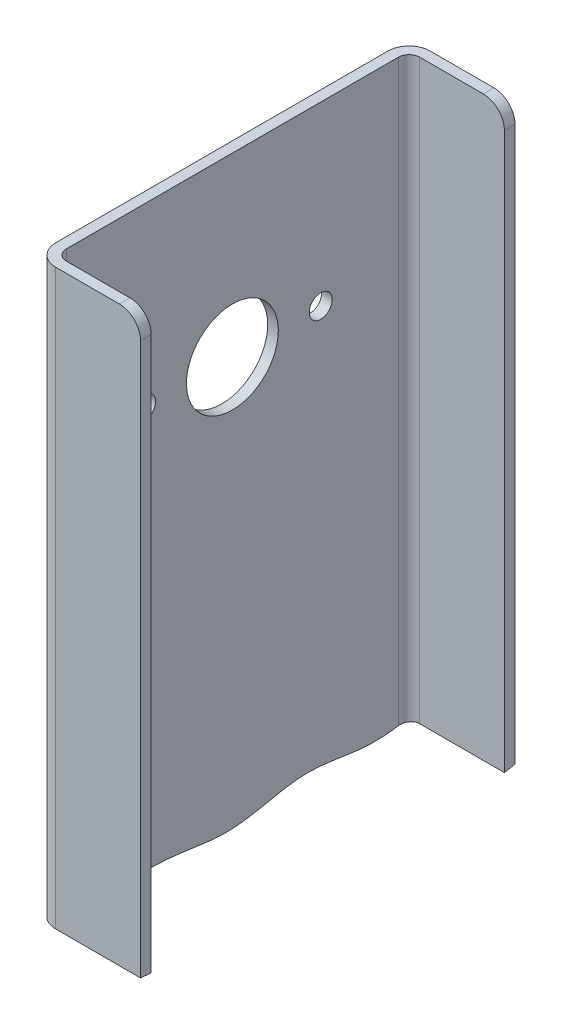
ISO-10303-21;
HEADER;
FILE_DESCRIPTION(('STEP AP214'),'2;1');
FILE_NAME('part.step','',(''),(''),'','','');
FILE_SCHEMA(('AUTOMOTIVE_DESIGN { 1 0 10303 214 1 1 1 1 }'));
ENDSEC;
DATA;
#1=APPLICATION_CONTEXT('core data for automotive mechanical design processes');
#2=APPLICATION_PROTOCOL_DEFINITION('international standard','automotive_design',2000,#1);
#3=PRODUCT_CONTEXT('',#1,'mechanical');
#4=PRODUCT('Part','Part','',(#3));
#5=PRODUCT_RELATED_PRODUCT_CATEGORY('part','',(#4));
#6=PRODUCT_DEFINITION_FORMATION('','',#4);
#7=PRODUCT_DEFINITION_CONTEXT('part definition',#1,'design');
#8=PRODUCT_DEFINITION('design','',#6,#7);
#9=PRODUCT_DEFINITION_SHAPE('','',#8);
#10=(LENGTH_UNIT() NAMED_UNIT(*) SI_UNIT(.MILLI.,.METRE.));
#11=(NAMED_UNIT(*) PLANE_ANGLE_UNIT() SI_UNIT($,.RADIAN.));
#12=(NAMED_UNIT(*) SI_UNIT($,.STERADIAN.) SOLID_ANGLE_UNIT());
#13=UNCERTAINTY_MEASURE_WITH_UNIT(LENGTH_MEASURE(1.E-05),#10,'distance_accuracy_value','');
#14=(GEOMETRIC_REPRESENTATION_CONTEXT(3) GLOBAL_UNCERTAINTY_ASSIGNED_CONTEXT((#13)) GLOBAL_UNIT_ASSIGNED_CONTEXT((#10,
#11,#12)) REPRESENTATION_CONTEXT('',''));
#15=CARTESIAN_POINT('',(0.,0.,0.));
#16=DIRECTION('',(0.,0.,1.));
#17=DIRECTION('',(1.,0.,0.));
#18=AXIS2_PLACEMENT_3D('',#15,#16,#17);
#19=CARTESIAN_POINT('',(-173.,50.,-50.));
#20=DIRECTION('',(-1.,0.,0.));
#21=DIRECTION('',(0.,0.,1.));
#22=AXIS2_PLACEMENT_3D('',#19,#20,#21);
#23=PLANE('',#22);
#24=DIRECTION('',(0.,-1.,0.));
#25=VECTOR('',#24,1.);
#26=CARTESIAN_POINT('',(-173.,50.,-50.));
#27=LINE('',#26,#25);
#28=CARTESIAN_POINT('',(-173.,44.,-50.));
#29=VERTEX_POINT('',#28);
#30=CARTESIAN_POINT('',(-173.,-113.389069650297,-50.));
#31=VERTEX_POINT('',#30);
#32=EDGE_CURVE('E201',#29,#31,#27,.T.);
#33=ORIENTED_EDGE('',*,*,#32,.T.);
#34=CARTESIAN_POINT('',(-173.,-108.266429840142,-76.1179396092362));
#35=CARTESIAN_POINT('',(-173.,-108.204464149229,-77.3842599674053));
#36=CARTESIAN_POINT('',(-173.,-107.966714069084,-104.339611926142));
#37=CARTESIAN_POINT('',(-173.,-203.054028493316,-17.9744398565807));
#38=CARTESIAN_POINT('',(-173.,-217.819929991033,99.5280629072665));
#39=CARTESIAN_POINT('',(-173.,-104.260663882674,80.2182620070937));
#40=CARTESIAN_POINT('',(-173.,-115.070398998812,39.9515463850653));
#41=CARTESIAN_POINT('',(-173.,-112.705959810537,18.8776705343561));
#42=CARTESIAN_POINT('',(-173.,-117.772848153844,-0.527481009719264));
#43=CARTESIAN_POINT('',(-173.,-110.455661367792,-19.7352920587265));
#44=CARTESIAN_POINT('',(-173.,-117.764317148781,-45.5043557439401));
#45=CARTESIAN_POINT('',(-173.,-108.904823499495,-63.071834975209));
#46=CARTESIAN_POINT('',(-173.,-108.266429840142,-76.1179396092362));
#47=B_SPLINE_CURVE_WITH_KNOTS('',3,(#34,#35,#36,#37,#38,#39,#40,#41,#42,#43,#44,#45,#46),
.UNSPECIFIED.,.T.,.F.,(4,1,1,1,1,1,1,1,1,1,4),(0.,0.00913955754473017,0.192956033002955,
0.490307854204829,0.648909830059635,0.717473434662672,0.760124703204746,0.809082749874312,
0.861430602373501,0.905840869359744,1.),.UNSPECIFIED.);
#48=CARTESIAN_POINT('',(-173.,-112.761123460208,-52.9999999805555));
#49=VERTEX_POINT('',#48);
#50=EDGE_CURVE('E312',#31,#49,#47,.T.);
#51=ORIENTED_EDGE('',*,*,#50,.T.);
#52=DIRECTION('',(0.,-1.,0.));
#53=VECTOR('',#52,1.);
#54=CARTESIAN_POINT('',(-173.,50.,-53.));
#55=LINE('',#54,#53);
#56=CARTESIAN_POINT('',(-173.,44.,-53.));
#57=VERTEX_POINT('',#56);
#58=EDGE_CURVE('E193',#57,#49,#55,.T.);
#59=ORIENTED_EDGE('',*,*,#58,.F.);
#60=DIRECTION('',(0.,0.,-1.));
#61=VECTOR('',#60,1.);
#62=CARTESIAN_POINT('',(-173.,44.,-50.));
#63=LINE('',#62,#61);
#64=EDGE_CURVE('E164',#57,#29,#63,.F.);
#65=ORIENTED_EDGE('',*,*,#64,.T.);
#66=EDGE_LOOP('',(#33,#51,#59,#65));
#67=FACE_BOUND('',#66,.T.);
#68=ADVANCED_FACE('F31',(#67),#23,.F.);
#69=CARTESIAN_POINT('',(-173.,50.,-53.));
#70=DIRECTION('',(0.,0.,1.));
#71=DIRECTION('',(1.,0.,0.));
#72=AXIS2_PLACEMENT_3D('',#69,#70,#71);
#73=PLANE('',#72);
#74=ORIENTED_EDGE('',*,*,#58,.T.);
#75=DIRECTION('',(-1.,0.,0.));
#76=VECTOR('',#75,1.);
#77=CARTESIAN_POINT('',(-143.,-112.761123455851,-53.));
#78=LINE('',#77,#76);
#79=CARTESIAN_POINT('',(-197.,-112.761123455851,-53.));
#80=VERTEX_POINT('',#79);
#81=EDGE_CURVE('E245',#49,#80,#78,.T.);
#82=ORIENTED_EDGE('',*,*,#81,.T.);
#83=DIRECTION('',(0.,-1.,0.));
#84=VECTOR('',#83,1.);
#85=CARTESIAN_POINT('',(-197.,50.,-53.));
#86=LINE('',#85,#84);
#87=CARTESIAN_POINT('',(-197.,50.,-53.));
#88=VERTEX_POINT('',#87);
#89=EDGE_CURVE('E168',#80,#88,#86,.F.);
#90=ORIENTED_EDGE('',*,*,#89,.T.);
#91=DIRECTION('',(-1.,0.,0.));
#92=VECTOR('',#91,1.);
#93=CARTESIAN_POINT('',(-173.,50.,-53.));
#94=LINE('',#93,#92);
#95=CARTESIAN_POINT('',(-179.,50.,-53.));
#96=VERTEX_POINT('',#95);
#97=EDGE_CURVE('E218',#96,#88,#94,.T.);
#98=ORIENTED_EDGE('',*,*,#97,.F.);
#99=CARTESIAN_POINT('',(-179.,44.,-53.));
#100=DIRECTION('',(0.,0.,1.));
#101=DIRECTION('',(1.,0.,0.));
#102=AXIS2_PLACEMENT_3D('',#99,#100,#101);
#103=CIRCLE('',#102,6.);
#104=EDGE_CURVE('E166',#96,#57,#103,.F.);
#105=ORIENTED_EDGE('',*,*,#104,.T.);
#106=EDGE_LOOP('',(#74,#82,#90,#98,#105));
#107=FACE_BOUND('',#106,.T.);
#108=ADVANCED_FACE('F324',(#107),#73,.F.);
#109=CARTESIAN_POINT('',(-203.,50.,-53.));
#110=DIRECTION('',(1.,0.,0.));
#111=DIRECTION('',(0.,0.,-1.));
#112=AXIS2_PLACEMENT_3D('',#109,#110,#111);
#113=PLANE('',#112);
#114=CARTESIAN_POINT('',(-203.,0.,25.));
#115=DIRECTION('',(1.,0.,0.));
#116=DIRECTION('',(0.,0.,-1.));
#117=AXIS2_PLACEMENT_3D('',#114,#115,#116);
#118=CIRCLE('',#117,3.25);
#119=CARTESIAN_POINT('',(-203.,0.,21.75));
#120=VERTEX_POINT('',#119);
#121=EDGE_CURVE('E233',#120,#120,#118,.T.);
#122=ORIENTED_EDGE('',*,*,#121,.T.);
#123=EDGE_LOOP('',(#122));
#124=FACE_BOUND('',#123,.T.);
#125=CARTESIAN_POINT('',(-203.,0.,-25.));
#126=DIRECTION('',(1.,0.,0.));
#127=DIRECTION('',(0.,0.,-1.));
#128=AXIS2_PLACEMENT_3D('',#125,#126,#127);
#129=CIRCLE('',#128,3.25);
#130=CARTESIAN_POINT('',(-203.,0.,-28.25));
#131=VERTEX_POINT('',#130);
#132=EDGE_CURVE('E227',#131,#131,#129,.T.);
#133=ORIENTED_EDGE('',*,*,#132,.T.);
#134=EDGE_LOOP('',(#133));
#135=FACE_BOUND('',#134,.T.);
#136=CARTESIAN_POINT('',(-203.,0.,0.));
#137=DIRECTION('',(1.,0.,0.));
#138=DIRECTION('',(0.,0.,-1.));
#139=AXIS2_PLACEMENT_3D('',#136,#137,#138);
#140=CIRCLE('',#139,13.);
#141=CARTESIAN_POINT('',(-203.,0.,-13.));
#142=VERTEX_POINT('',#141);
#143=EDGE_CURVE('E221',#142,#142,#140,.T.);
#144=ORIENTED_EDGE('',*,*,#143,.T.);
#145=EDGE_LOOP('',(#144));
#146=FACE_BOUND('',#145,.T.);
#147=DIRECTION('',(0.,-1.,0.));
#148=VECTOR('',#147,1.);
#149=CARTESIAN_POINT('',(-203.,50.,-47.));
#150=LINE('',#149,#148);
#151=CARTESIAN_POINT('',(-203.,50.,-47.));
#152=VERTEX_POINT('',#151);
#153=CARTESIAN_POINT('',(-203.,-113.901930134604,-46.9999999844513));
#154=VERTEX_POINT('',#153);
#155=EDGE_CURVE('E43',#152,#154,#150,.T.);
#156=ORIENTED_EDGE('',*,*,#155,.T.);
#157=CARTESIAN_POINT('',(-203.,-108.266429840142,-76.1179396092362));
#158=CARTESIAN_POINT('',(-203.,-108.204464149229,-77.3842599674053));
#159=CARTESIAN_POINT('',(-203.,-107.966714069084,-104.339611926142));
#160=CARTESIAN_POINT('',(-203.,-203.054028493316,-17.9744398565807));
#161=CARTESIAN_POINT('',(-203.,-217.819929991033,99.5280629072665));
#162=CARTESIAN_POINT('',(-203.,-104.260663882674,80.2182620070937));
#163=CARTESIAN_POINT('',(-203.,-115.070398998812,39.9515463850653));
#164=CARTESIAN_POINT('',(-203.,-112.705959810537,18.8776705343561));
#165=CARTESIAN_POINT('',(-203.,-117.772848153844,-0.527481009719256));
#166=CARTESIAN_POINT('',(-203.,-110.455661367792,-19.7352920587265));
#167=CARTESIAN_POINT('',(-203.,-117.764317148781,-45.5043557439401));
#168=CARTESIAN_POINT('',(-203.,-108.904823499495,-63.071834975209));
#169=CARTESIAN_POINT('',(-203.,-108.266429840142,-76.1179396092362));
#170=B_SPLINE_CURVE_WITH_KNOTS('',3,(#157,#158,#159,#160,#161,#162,#163,#164,#165,#166,#167,
#168,#169),.UNSPECIFIED.,.T.,.F.,(4,1,1,1,1,1,1,1,1,1,4),(0.,0.00913955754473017,
0.192956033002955,0.490307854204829,0.648909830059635,0.717473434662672,0.760124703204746,
0.809082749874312,0.861430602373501,0.905840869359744,1.),.UNSPECIFIED.);
#171=CARTESIAN_POINT('',(-203.,-112.80783605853,47.0000000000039));
#172=VERTEX_POINT('',#171);
#173=EDGE_CURVE('E136',#172,#154,#170,.T.);
#174=ORIENTED_EDGE('',*,*,#173,.F.);
#175=DIRECTION('',(0.,-1.,0.));
#176=VECTOR('',#175,1.);
#177=CARTESIAN_POINT('',(-203.,50.,47.));
#178=LINE('',#177,#176);
#179=CARTESIAN_POINT('',(-203.,50.,47.));
#180=VERTEX_POINT('',#179);
#181=EDGE_CURVE('E146',#172,#180,#178,.F.);
#182=ORIENTED_EDGE('',*,*,#181,.T.);
#183=DIRECTION('',(0.,0.,1.));
#184=VECTOR('',#183,1.);
#185=CARTESIAN_POINT('',(-203.,50.,-53.));
#186=LINE('',#185,#184);
#187=EDGE_CURVE('E216',#152,#180,#186,.T.);
#188=ORIENTED_EDGE('',*,*,#187,.F.);
#189=EDGE_LOOP('',(#156,#174,#182,#188));
#190=FACE_BOUND('',#189,.T.);
#191=ADVANCED_FACE('F144',(#124,#135,#146,#190),#113,.F.);
#192=CARTESIAN_POINT('',(-203.,50.,53.));
#193=DIRECTION('',(0.,0.,-1.));
#194=DIRECTION('',(-1.,0.,0.));
#195=AXIS2_PLACEMENT_3D('',#192,#193,#194);
#196=PLANE('',#195);
#197=DIRECTION('',(0.,-1.,0.));
#198=VECTOR('',#197,1.);
#199=CARTESIAN_POINT('',(-197.,50.,53.));
#200=LINE('',#199,#198);
#201=CARTESIAN_POINT('',(-197.,50.,53.));
#202=VERTEX_POINT('',#201);
#203=CARTESIAN_POINT('',(-197.,-112.224054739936,53.));
#204=VERTEX_POINT('',#203);
#205=EDGE_CURVE('E155',#202,#204,#200,.T.);
#206=ORIENTED_EDGE('',*,*,#205,.T.);
#207=DIRECTION('',(-1.,0.,0.));
#208=VECTOR('',#207,1.);
#209=CARTESIAN_POINT('',(-143.,-112.224054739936,53.));
#210=LINE('',#209,#208);
#211=CARTESIAN_POINT('',(-173.,-112.224054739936,53.));
#212=VERTEX_POINT('',#211);
#213=EDGE_CURVE('E49',#204,#212,#210,.F.);
#214=ORIENTED_EDGE('',*,*,#213,.T.);
#215=DIRECTION('',(0.,-1.,0.));
#216=VECTOR('',#215,1.);
#217=CARTESIAN_POINT('',(-173.,50.,53.));
#218=LINE('',#217,#216);
#219=CARTESIAN_POINT('',(-173.,44.,53.));
#220=VERTEX_POINT('',#219);
#221=EDGE_CURVE('E196',#220,#212,#218,.T.);
#222=ORIENTED_EDGE('',*,*,#221,.F.);
#223=CARTESIAN_POINT('',(-179.,44.,53.));
#224=DIRECTION('',(0.,0.,-1.));
#225=DIRECTION('',(-1.,0.,0.));
#226=AXIS2_PLACEMENT_3D('',#223,#224,#225);
#227=CIRCLE('',#226,6.);
#228=CARTESIAN_POINT('',(-179.,50.,53.));
#229=VERTEX_POINT('',#228);
#230=EDGE_CURVE('E153',#220,#229,#227,.F.);
#231=ORIENTED_EDGE('',*,*,#230,.T.);
#232=DIRECTION('',(1.,0.,0.));
#233=VECTOR('',#232,1.);
#234=CARTESIAN_POINT('',(-203.,50.,53.));
#235=LINE('',#234,#233);
#236=EDGE_CURVE('E213',#202,#229,#235,.T.);
#237=ORIENTED_EDGE('',*,*,#236,.F.);
#238=EDGE_LOOP('',(#206,#214,#222,#231,#237));
#239=FACE_BOUND('',#238,.T.);
#240=ADVANCED_FACE('F357',(#239),#196,.F.);
#241=CARTESIAN_POINT('',(-173.,50.,53.));
#242=DIRECTION('',(-1.,0.,0.));
#243=DIRECTION('',(0.,0.,1.));
#244=AXIS2_PLACEMENT_3D('',#241,#242,#243);
#245=PLANE('',#244);
#246=ORIENTED_EDGE('',*,*,#221,.T.);
#247=CARTESIAN_POINT('',(-173.,-108.266429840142,-76.1179396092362));
#248=CARTESIAN_POINT('',(-173.,-108.204464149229,-77.3842599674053));
#249=CARTESIAN_POINT('',(-173.,-107.966714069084,-104.339611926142));
#250=CARTESIAN_POINT('',(-173.,-203.054028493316,-17.9744398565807));
#251=CARTESIAN_POINT('',(-173.,-217.819929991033,99.5280629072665));
#252=CARTESIAN_POINT('',(-173.,-104.260663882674,80.2182620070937));
#253=CARTESIAN_POINT('',(-173.,-115.070398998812,39.9515463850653));
#254=CARTESIAN_POINT('',(-173.,-112.705959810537,18.8776705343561));
#255=CARTESIAN_POINT('',(-173.,-117.772848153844,-0.527481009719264));
#256=CARTESIAN_POINT('',(-173.,-110.455661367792,-19.7352920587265));
#257=CARTESIAN_POINT('',(-173.,-117.764317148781,-45.5043557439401));
#258=CARTESIAN_POINT('',(-173.,-108.904823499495,-63.071834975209));
#259=CARTESIAN_POINT('',(-173.,-108.266429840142,-76.1179396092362));
#260=B_SPLINE_CURVE_WITH_KNOTS('',3,(#247,#248,#249,#250,#251,#252,#253,#254,#255,#256,#257,
#258,#259),.UNSPECIFIED.,.T.,.F.,(4,1,1,1,1,1,1,1,1,1,4),(0.,0.00913955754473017,
0.192956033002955,0.490307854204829,0.648909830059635,0.717473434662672,0.760124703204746,
0.809082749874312,0.861430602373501,0.905840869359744,1.),.UNSPECIFIED.);
#261=CARTESIAN_POINT('',(-173.,-112.479322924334,50.000000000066));
#262=VERTEX_POINT('',#261);
#263=EDGE_CURVE('E268',#212,#262,#260,.T.);
#264=ORIENTED_EDGE('',*,*,#263,.T.);
#265=DIRECTION('',(0.,-1.,0.));
#266=VECTOR('',#265,1.);
#267=CARTESIAN_POINT('',(-173.,50.,50.));
#268=LINE('',#267,#266);
#269=CARTESIAN_POINT('',(-173.,44.,50.));
#270=VERTEX_POINT('',#269);
#271=EDGE_CURVE('E198',#270,#262,#268,.T.);
#272=ORIENTED_EDGE('',*,*,#271,.F.);
#273=DIRECTION('',(0.,0.,-1.));
#274=VECTOR('',#273,1.);
#275=CARTESIAN_POINT('',(-173.,44.,53.));
#276=LINE('',#275,#274);
#277=EDGE_CURVE('E57',#270,#220,#276,.F.);
#278=ORIENTED_EDGE('',*,*,#277,.T.);
#279=EDGE_LOOP('',(#246,#264,#272,#278));
#280=FACE_BOUND('',#279,.T.);
#281=ADVANCED_FACE('F350',(#280),#245,.F.);
#282=CARTESIAN_POINT('',(-173.,50.,50.));
#283=DIRECTION('',(0.,0.,1.));
#284=DIRECTION('',(1.,0.,0.));
#285=AXIS2_PLACEMENT_3D('',#282,#283,#284);
#286=PLANE('',#285);
#287=ORIENTED_EDGE('',*,*,#271,.T.);
#288=DIRECTION('',(-1.,0.,0.));
#289=VECTOR('',#288,1.);
#290=CARTESIAN_POINT('',(-143.,-112.479322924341,50.));
#291=LINE('',#290,#289);
#292=CARTESIAN_POINT('',(-197.,-112.479322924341,50.));
#293=VERTEX_POINT('',#292);
#294=EDGE_CURVE('E273',#262,#293,#291,.T.);
#295=ORIENTED_EDGE('',*,*,#294,.T.);
#296=DIRECTION('',(0.,-1.,0.));
#297=VECTOR('',#296,1.);
#298=CARTESIAN_POINT('',(-197.,50.,50.));
#299=LINE('',#298,#297);
#300=CARTESIAN_POINT('',(-197.,50.,50.));
#301=VERTEX_POINT('',#300);
#302=EDGE_CURVE('E183',#293,#301,#299,.F.);
#303=ORIENTED_EDGE('',*,*,#302,.T.);
#304=DIRECTION('',(-1.,0.,0.));
#305=VECTOR('',#304,1.);
#306=CARTESIAN_POINT('',(-173.,50.,50.));
#307=LINE('',#306,#305);
#308=CARTESIAN_POINT('',(-179.,50.,50.));
#309=VERTEX_POINT('',#308);
#310=EDGE_CURVE('E210',#309,#301,#307,.T.);
#311=ORIENTED_EDGE('',*,*,#310,.F.);
#312=CARTESIAN_POINT('',(-179.,44.,50.));
#313=DIRECTION('',(0.,0.,1.));
#314=DIRECTION('',(1.,0.,0.));
#315=AXIS2_PLACEMENT_3D('',#312,#313,#314);
#316=CIRCLE('',#315,6.);
#317=EDGE_CURVE('E160',#309,#270,#316,.F.);
#318=ORIENTED_EDGE('',*,*,#317,.T.);
#319=EDGE_LOOP('',(#287,#295,#303,#311,#318));
#320=FACE_BOUND('',#319,.T.);
#321=ADVANCED_FACE('F348',(#320),#286,.F.);
#322=CARTESIAN_POINT('',(-200.,50.,50.));
#323=DIRECTION('',(-1.,0.,0.));
#324=DIRECTION('',(0.,0.,1.));
#325=AXIS2_PLACEMENT_3D('',#322,#323,#324);
#326=PLANE('',#325);
#327=CARTESIAN_POINT('',(-200.,0.,25.));
#328=DIRECTION('',(1.,0.,0.));
#329=DIRECTION('',(0.,0.,-1.));
#330=AXIS2_PLACEMENT_3D('',#327,#328,#329);
#331=CIRCLE('',#330,3.25);
#332=CARTESIAN_POINT('',(-200.,0.,21.75));
#333=VERTEX_POINT('',#332);
#334=EDGE_CURVE('E236',#333,#333,#331,.T.);
#335=ORIENTED_EDGE('',*,*,#334,.F.);
#336=EDGE_LOOP('',(#335));
#337=FACE_BOUND('',#336,.T.);
#338=CARTESIAN_POINT('',(-200.,0.,-25.));
#339=DIRECTION('',(1.,0.,0.));
#340=DIRECTION('',(0.,0.,-1.));
#341=AXIS2_PLACEMENT_3D('',#338,#339,#340);
#342=CIRCLE('',#341,3.25);
#343=CARTESIAN_POINT('',(-200.,0.,-28.25));
#344=VERTEX_POINT('',#343);
#345=EDGE_CURVE('E230',#344,#344,#342,.T.);
#346=ORIENTED_EDGE('',*,*,#345,.F.);
#347=EDGE_LOOP('',(#346));
#348=FACE_BOUND('',#347,.T.);
#349=CARTESIAN_POINT('',(-200.,0.,0.));
#350=DIRECTION('',(1.,0.,0.));
#351=DIRECTION('',(0.,0.,-1.));
#352=AXIS2_PLACEMENT_3D('',#349,#350,#351);
#353=CIRCLE('',#352,13.);
#354=CARTESIAN_POINT('',(-200.,0.,-13.));
#355=VERTEX_POINT('',#354);
#356=EDGE_CURVE('E224',#355,#355,#353,.T.);
#357=ORIENTED_EDGE('',*,*,#356,.F.);
#358=EDGE_LOOP('',(#357));
#359=FACE_BOUND('',#358,.T.);
#360=DIRECTION('',(0.,-1.,0.));
#361=VECTOR('',#360,1.);
#362=CARTESIAN_POINT('',(-200.,-120.,47.));
#363=LINE('',#362,#361);
#364=CARTESIAN_POINT('',(-200.,50.,47.));
#365=VERTEX_POINT('',#364);
#366=CARTESIAN_POINT('',(-200.,-112.807836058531,47.));
#367=VERTEX_POINT('',#366);
#368=EDGE_CURVE('E187',#365,#367,#363,.T.);
#369=ORIENTED_EDGE('',*,*,#368,.T.);
#370=CARTESIAN_POINT('',(-200.,-108.266429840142,-76.1179396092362));
#371=CARTESIAN_POINT('',(-200.,-108.204464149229,-77.3842599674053));
#372=CARTESIAN_POINT('',(-200.,-107.966714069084,-104.339611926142));
#373=CARTESIAN_POINT('',(-200.,-203.054028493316,-17.9744398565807));
#374=CARTESIAN_POINT('',(-200.,-217.819929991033,99.5280629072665));
#375=CARTESIAN_POINT('',(-200.,-104.260663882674,80.2182620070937));
#376=CARTESIAN_POINT('',(-200.,-115.070398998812,39.9515463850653));
#377=CARTESIAN_POINT('',(-200.,-112.705959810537,18.8776705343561));
#378=CARTESIAN_POINT('',(-200.,-117.772848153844,-0.527481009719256));
#379=CARTESIAN_POINT('',(-200.,-110.455661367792,-19.7352920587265));
#380=CARTESIAN_POINT('',(-200.,-117.764317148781,-45.5043557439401));
#381=CARTESIAN_POINT('',(-200.,-108.904823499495,-63.071834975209));
#382=CARTESIAN_POINT('',(-200.,-108.266429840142,-76.1179396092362));
#383=B_SPLINE_CURVE_WITH_KNOTS('',3,(#370,#371,#372,#373,#374,#375,#376,#377,#378,#379,#380,
#381,#382),.UNSPECIFIED.,.T.,.F.,(4,1,1,1,1,1,1,1,1,1,4),(0.,0.00913955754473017,
0.192956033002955,0.490307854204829,0.648909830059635,0.717473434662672,0.760124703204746,
0.809082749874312,0.861430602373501,0.905840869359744,1.),.UNSPECIFIED.);
#384=CARTESIAN_POINT('',(-200.,-113.901930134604,-46.9999999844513));
#385=VERTEX_POINT('',#384);
#386=EDGE_CURVE('E286',#367,#385,#383,.T.);
#387=ORIENTED_EDGE('',*,*,#386,.T.);
#388=DIRECTION('',(0.,-1.,0.));
#389=VECTOR('',#388,1.);
#390=CARTESIAN_POINT('',(-200.,50.,-47.));
#391=LINE('',#390,#389);
#392=CARTESIAN_POINT('',(-200.,50.,-47.));
#393=VERTEX_POINT('',#392);
#394=EDGE_CURVE('E185',#385,#393,#391,.F.);
#395=ORIENTED_EDGE('',*,*,#394,.T.);
#396=DIRECTION('',(0.,0.,-1.));
#397=VECTOR('',#396,1.);
#398=CARTESIAN_POINT('',(-200.,50.,50.));
#399=LINE('',#398,#397);
#400=EDGE_CURVE('E207',#365,#393,#399,.T.);
#401=ORIENTED_EDGE('',*,*,#400,.F.);
#402=EDGE_LOOP('',(#369,#387,#395,#401));
#403=FACE_BOUND('',#402,.T.);
#404=ADVANCED_FACE('F343',(#337,#348,#359,#403),#326,.F.);
#405=CARTESIAN_POINT('',(-200.,50.,-50.));
#406=DIRECTION('',(0.,0.,-1.));
#407=DIRECTION('',(-1.,0.,0.));
#408=AXIS2_PLACEMENT_3D('',#405,#406,#407);
#409=PLANE('',#408);
#410=DIRECTION('',(0.,-1.,0.));
#411=VECTOR('',#410,1.);
#412=CARTESIAN_POINT('',(-197.,-120.,-50.));
#413=LINE('',#412,#411);
#414=CARTESIAN_POINT('',(-197.,50.,-50.));
#415=VERTEX_POINT('',#414);
#416=CARTESIAN_POINT('',(-197.,-113.389069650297,-50.));
#417=VERTEX_POINT('',#416);
#418=EDGE_CURVE('E190',#415,#417,#413,.T.);
#419=ORIENTED_EDGE('',*,*,#418,.T.);
#420=DIRECTION('',(-1.,0.,0.));
#421=VECTOR('',#420,1.);
#422=CARTESIAN_POINT('',(-143.,-113.389069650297,-50.));
#423=LINE('',#422,#421);
#424=EDGE_CURVE('E310',#417,#31,#423,.F.);
#425=ORIENTED_EDGE('',*,*,#424,.T.);
#426=ORIENTED_EDGE('',*,*,#32,.F.);
#427=CARTESIAN_POINT('',(-179.,44.,-50.));
#428=DIRECTION('',(0.,0.,-1.));
#429=DIRECTION('',(-1.,0.,0.));
#430=AXIS2_PLACEMENT_3D('',#427,#428,#429);
#431=CIRCLE('',#430,6.);
#432=CARTESIAN_POINT('',(-179.,50.,-50.));
#433=VERTEX_POINT('',#432);
#434=EDGE_CURVE('E162',#29,#433,#431,.F.);
#435=ORIENTED_EDGE('',*,*,#434,.T.);
#436=DIRECTION('',(1.,0.,0.));
#437=VECTOR('',#436,1.);
#438=CARTESIAN_POINT('',(-200.,50.,-50.));
#439=LINE('',#438,#437);
#440=EDGE_CURVE('E204',#415,#433,#439,.T.);
#441=ORIENTED_EDGE('',*,*,#440,.F.);
#442=EDGE_LOOP('',(#419,#425,#426,#435,#441));
#443=FACE_BOUND('',#442,.T.);
#444=ADVANCED_FACE('F336',(#443),#409,.F.);
#445=CARTESIAN_POINT('',(-173.,50.,-53.));
#446=DIRECTION('',(0.,1.,0.));
#447=DIRECTION('',(0.,0.,1.));
#448=AXIS2_PLACEMENT_3D('',#445,#446,#447);
#449=PLANE('',#448);
#450=ORIENTED_EDGE('',*,*,#440,.T.);
#451=DIRECTION('',(0.,0.,-1.));
#452=VECTOR('',#451,1.);
#453=CARTESIAN_POINT('',(-179.,50.,-53.0000000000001));
#454=LINE('',#453,#452);
#455=EDGE_CURVE('E170',#433,#96,#454,.T.);
#456=ORIENTED_EDGE('',*,*,#455,.T.);
#457=ORIENTED_EDGE('',*,*,#97,.T.);
#458=CARTESIAN_POINT('',(-197.,50.,-47.));
#459=DIRECTION('',(0.,1.,0.));
#460=DIRECTION('',(0.,0.,1.));
#461=AXIS2_PLACEMENT_3D('',#458,#459,#460);
#462=CIRCLE('',#461,6.);
#463=EDGE_CURVE('E176',#88,#152,#462,.T.);
#464=ORIENTED_EDGE('',*,*,#463,.T.);
#465=ORIENTED_EDGE('',*,*,#187,.T.);
#466=CARTESIAN_POINT('',(-197.,50.,47.));
#467=DIRECTION('',(0.,1.,0.));
#468=DIRECTION('',(0.,0.,1.));
#469=AXIS2_PLACEMENT_3D('',#466,#467,#468);
#470=CIRCLE('',#469,6.);
#471=EDGE_CURVE('E152',#180,#202,#470,.T.);
#472=ORIENTED_EDGE('',*,*,#471,.T.);
#473=ORIENTED_EDGE('',*,*,#236,.T.);
#474=DIRECTION('',(0.,0.,-1.));
#475=VECTOR('',#474,1.);
#476=CARTESIAN_POINT('',(-179.,50.,50.));
#477=LINE('',#476,#475);
#478=EDGE_CURVE('E173',#229,#309,#477,.T.);
#479=ORIENTED_EDGE('',*,*,#478,.T.);
#480=ORIENTED_EDGE('',*,*,#310,.T.);
#481=CARTESIAN_POINT('',(-197.,50.,47.));
#482=DIRECTION('',(0.,1.,0.));
#483=DIRECTION('',(0.,0.,1.));
#484=AXIS2_PLACEMENT_3D('',#481,#482,#483);
#485=CIRCLE('',#484,3.);
#486=EDGE_CURVE('E179',#301,#365,#485,.F.);
#487=ORIENTED_EDGE('',*,*,#486,.T.);
#488=ORIENTED_EDGE('',*,*,#400,.T.);
#489=CARTESIAN_POINT('',(-197.,50.,-47.));
#490=DIRECTION('',(0.,1.,0.));
#491=DIRECTION('',(0.,0.,1.));
#492=AXIS2_PLACEMENT_3D('',#489,#490,#491);
#493=CIRCLE('',#492,3.);
#494=EDGE_CURVE('E181',#393,#415,#493,.F.);
#495=ORIENTED_EDGE('',*,*,#494,.T.);
#496=EDGE_LOOP('',(#450,#456,#457,#464,#465,#472,#473,#479,#480,#487,#488,#495));
#497=FACE_BOUND('',#496,.T.);
#498=ADVANCED_FACE('F301',(#497),#449,.T.);
#499=CARTESIAN_POINT('',(-197.,50.,-47.));
#500=DIRECTION('',(0.,1.,0.));
#501=DIRECTION('',(0.,0.,1.));
#502=AXIS2_PLACEMENT_3D('',#499,#500,#501);
#503=CYLINDRICAL_SURFACE('',#502,3.);
#504=ORIENTED_EDGE('',*,*,#394,.F.);
#505=CARTESIAN_POINT('',(-200.,-113.901930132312,-47.));
#506=CARTESIAN_POINT('',(-200.000007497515,-113.889344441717,-47.0853804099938));
#507=CARTESIAN_POINT('',(-199.996355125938,-113.876573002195,-47.1707284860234));
#508=CARTESIAN_POINT('',(-199.98180343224,-113.850768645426,-47.3407597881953));
#509=CARTESIAN_POINT('',(-199.970904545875,-113.837735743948,-47.4254430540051));
#510=CARTESIAN_POINT('',(-199.941940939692,-113.811524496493,-47.5935065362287));
#511=CARTESIAN_POINT('',(-199.923880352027,-113.798346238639,-47.6768874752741));
#512=CARTESIAN_POINT('',(-199.880741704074,-113.771961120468,-47.8417839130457));
#513=CARTESIAN_POINT('',(-199.855663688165,-113.758754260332,-47.9232994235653));
#514=CARTESIAN_POINT('',(-199.770106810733,-113.719263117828,-48.1642605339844));
#515=CARTESIAN_POINT('',(-199.699291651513,-113.693096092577,-48.3201984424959));
#516=CARTESIAN_POINT('',(-199.532139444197,-113.642190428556,-48.6178500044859));
#517=CARTESIAN_POINT('',(-199.43580718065,-113.617451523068,-48.7595663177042));
#518=CARTESIAN_POINT('',(-199.220396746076,-113.57047699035,-49.0245802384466));
#519=CARTESIAN_POINT('',(-199.101361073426,-113.54823680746,-49.147911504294));
#520=CARTESIAN_POINT('',(-198.843672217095,-113.507206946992,-49.3727867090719));
#521=CARTESIAN_POINT('',(-198.705016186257,-113.488417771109,-49.4743274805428));
#522=CARTESIAN_POINT('',(-198.413892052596,-113.45538920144,-49.6513349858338));
#523=CARTESIAN_POINT('',(-198.261619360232,-113.44109561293,-49.7271132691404));
#524=CARTESIAN_POINT('',(-197.946181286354,-113.41743305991,-49.8519203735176));
#525=CARTESIAN_POINT('',(-197.78302502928,-113.408060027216,-49.9009712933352));
#526=CARTESIAN_POINT('',(-197.515528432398,-113.397293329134,-49.9571935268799));
#527=CARTESIAN_POINT('',(-197.413035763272,-113.394213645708,-49.973235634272));
#528=CARTESIAN_POINT('',(-197.207044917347,-113.390101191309,-49.9946366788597));
#529=CARTESIAN_POINT('',(-197.103548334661,-113.389065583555,-50.0000104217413));
#530=CARTESIAN_POINT('',(-197.,-113.389069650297,-50.));
#531=B_SPLINE_CURVE_WITH_KNOTS('',3,(#505,#506,#507,#508,#509,#510,#511,#512,#513,#514,#515,
#516,#517,#518,#519,#520,#521,#522,#523,#524,#525,#526,#527,#528,#529,#530),.UNSPECIFIED.,.F.,
.F.,(4,2,2,2,2,2,2,2,2,2,2,2,4),(0.,0.258823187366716,0.51763081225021,0.77628932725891,
1.03494620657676,1.55202350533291,2.0690039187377,2.58502593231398,3.10112290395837,
3.61073598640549,4.1199270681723,4.43075844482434,4.74115814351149),.UNSPECIFIED.);
#532=EDGE_CURVE('E304',#385,#417,#531,.T.);
#533=ORIENTED_EDGE('',*,*,#532,.T.);
#534=ORIENTED_EDGE('',*,*,#418,.F.);
#535=ORIENTED_EDGE('',*,*,#494,.F.);
#536=EDGE_LOOP('',(#504,#533,#534,#535));
#537=FACE_BOUND('',#536,.T.);
#538=ADVANCED_FACE('F296',(#537),#503,.F.);
#539=CARTESIAN_POINT('',(-197.,50.,47.));
#540=DIRECTION('',(0.,1.,0.));
#541=DIRECTION('',(0.,0.,1.));
#542=AXIS2_PLACEMENT_3D('',#539,#540,#541);
#543=CYLINDRICAL_SURFACE('',#542,3.);
#544=ORIENTED_EDGE('',*,*,#302,.F.);
#545=CARTESIAN_POINT('',(-197.,-112.479322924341,50.));
#546=CARTESIAN_POINT('',(-197.084052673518,-112.479322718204,50.0000083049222));
#547=CARTESIAN_POINT('',(-197.168101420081,-112.479677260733,49.9964676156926));
#548=CARTESIAN_POINT('',(-197.335595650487,-112.481093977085,49.9823524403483));
#549=CARTESIAN_POINT('',(-197.419041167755,-112.482156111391,49.9717783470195));
#550=CARTESIAN_POINT('',(-197.58467032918,-112.484984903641,49.9436728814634));
#551=CARTESIAN_POINT('',(-197.666855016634,-112.486750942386,49.9261476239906));
#552=CARTESIAN_POINT('',(-197.829427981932,-112.490981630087,49.8842858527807));
#553=CARTESIAN_POINT('',(-197.909816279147,-112.493446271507,49.8599494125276));
#554=CARTESIAN_POINT('',(-198.147505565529,-112.501883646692,49.7769294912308));
#555=CARTESIAN_POINT('',(-198.301404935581,-112.508901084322,49.7082227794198));
#556=CARTESIAN_POINT('',(-198.595343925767,-112.525619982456,49.5461892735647));
#557=CARTESIAN_POINT('',(-198.735385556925,-112.535321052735,49.4528660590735));
#558=CARTESIAN_POINT('',(-198.998083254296,-112.557275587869,49.2440702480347));
#559=CARTESIAN_POINT('',(-199.120705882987,-112.569533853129,49.1285560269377));
#560=CARTESIAN_POINT('',(-199.344842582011,-112.596351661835,48.8787968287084));
#561=CARTESIAN_POINT('',(-199.446352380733,-112.610911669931,48.7445480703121));
#562=CARTESIAN_POINT('',(-199.625927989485,-112.642070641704,48.4604437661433));
#563=CARTESIAN_POINT('',(-199.703870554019,-112.658679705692,48.3105115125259));
#564=CARTESIAN_POINT('',(-199.833462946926,-112.69343346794,47.9998862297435));
#565=CARTESIAN_POINT('',(-199.885125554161,-112.711577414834,47.8391984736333));
#566=CARTESIAN_POINT('',(-199.948570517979,-112.742824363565,47.5646965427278));
#567=CARTESIAN_POINT('',(-199.967846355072,-112.755660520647,47.4525247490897));
#568=CARTESIAN_POINT('',(-199.993559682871,-112.781592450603,47.2269147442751));
#569=CARTESIAN_POINT('',(-200.000015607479,-112.794687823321,47.1134785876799));
#570=CARTESIAN_POINT('',(-200.,-112.807836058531,47.));
#571=B_SPLINE_CURVE_WITH_KNOTS('',3,(#545,#546,#547,#548,#549,#550,#551,#552,#553,#554,#555,
#556,#557,#558,#559,#560,#561,#562,#563,#564,#565,#566,#567,#568,#569,#570),.UNSPECIFIED.,.F.,
.F.,(4,2,2,2,2,2,2,2,2,2,2,2,4),(0.,0.252075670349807,0.504137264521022,0.755977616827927,
1.00781525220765,1.511268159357,2.01464789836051,2.5189812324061,3.02341650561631,
3.53044584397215,4.03722839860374,4.38015872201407,4.72259558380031),.UNSPECIFIED.);
#572=EDGE_CURVE('E279',#293,#367,#571,.T.);
#573=ORIENTED_EDGE('',*,*,#572,.T.);
#574=ORIENTED_EDGE('',*,*,#368,.F.);
#575=ORIENTED_EDGE('',*,*,#486,.F.);
#576=EDGE_LOOP('',(#544,#573,#574,#575));
#577=FACE_BOUND('',#576,.T.);
#578=ADVANCED_FACE('F290',(#577),#543,.F.);
#579=CARTESIAN_POINT('',(-179.,44.,-53.0000000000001));
#580=DIRECTION('',(0.,0.,1.));
#581=DIRECTION('',(1.,0.,0.));
#582=AXIS2_PLACEMENT_3D('',#579,#580,#581);
#583=CYLINDRICAL_SURFACE('',#582,6.);
#584=ORIENTED_EDGE('',*,*,#434,.F.);
#585=ORIENTED_EDGE('',*,*,#64,.F.);
#586=ORIENTED_EDGE('',*,*,#104,.F.);
#587=ORIENTED_EDGE('',*,*,#455,.F.);
#588=EDGE_LOOP('',(#584,#585,#586,#587));
#589=FACE_BOUND('',#588,.T.);
#590=ADVANCED_FACE('F295',(#589),#583,.T.);
#591=CARTESIAN_POINT('',(-179.,44.,-53.));
#592=DIRECTION('',(0.,0.,1.));
#593=DIRECTION('',(1.,0.,0.));
#594=AXIS2_PLACEMENT_3D('',#591,#592,#593);
#595=CYLINDRICAL_SURFACE('',#594,6.);
#596=ORIENTED_EDGE('',*,*,#230,.F.);
#597=ORIENTED_EDGE('',*,*,#277,.F.);
#598=ORIENTED_EDGE('',*,*,#317,.F.);
#599=ORIENTED_EDGE('',*,*,#478,.F.);
#600=EDGE_LOOP('',(#596,#597,#598,#599));
#601=FACE_BOUND('',#600,.T.);
#602=ADVANCED_FACE('F353',(#601),#595,.T.);
#603=CARTESIAN_POINT('',(-197.,50.,-47.));
#604=DIRECTION('',(0.,-1.,0.));
#605=DIRECTION('',(0.,0.,-1.));
#606=AXIS2_PLACEMENT_3D('',#603,#604,#605);
#607=CYLINDRICAL_SURFACE('',#606,6.);
#608=CARTESIAN_POINT('',(-203.,-113.901930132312,-47.));
#609=CARTESIAN_POINT('',(-203.000016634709,-113.876701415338,-47.1711717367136));
#610=CARTESIAN_POINT('',(-202.992675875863,-113.850724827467,-47.3422253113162));
#611=CARTESIAN_POINT('',(-202.963458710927,-113.797574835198,-47.6828823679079));
#612=CARTESIAN_POINT('',(-202.941583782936,-113.770401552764,-47.8524859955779));
#613=CARTESIAN_POINT('',(-202.883498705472,-113.715172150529,-48.1889409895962));
#614=CARTESIAN_POINT('',(-202.8472991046,-113.687116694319,-48.3557942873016));
#615=CARTESIAN_POINT('',(-202.760852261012,-113.630433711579,-48.6857220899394));
#616=CARTESIAN_POINT('',(-202.710604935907,-113.601806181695,-48.8487965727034));
#617=CARTESIAN_POINT('',(-202.596423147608,-113.544323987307,-49.1700485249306));
#618=CARTESIAN_POINT('',(-202.532488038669,-113.515469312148,-49.3282257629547));
#619=CARTESIAN_POINT('',(-202.391349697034,-113.457882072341,-49.6386413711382));
#620=CARTESIAN_POINT('',(-202.314141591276,-113.429149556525,-49.7908775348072));
#621=CARTESIAN_POINT('',(-202.147032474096,-113.372194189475,-50.0882241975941));
#622=CARTESIAN_POINT('',(-202.057137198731,-113.343971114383,-50.2333378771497));
#623=CARTESIAN_POINT('',(-201.865192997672,-113.28837444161,-50.5155408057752));
#624=CARTESIAN_POINT('',(-201.763139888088,-113.261001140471,-50.6526272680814));
#625=CARTESIAN_POINT('',(-201.547394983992,-113.207423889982,-50.9179698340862));
#626=CARTESIAN_POINT('',(-201.433683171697,-113.181222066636,-51.0462100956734));
#627=CARTESIAN_POINT('',(-201.195535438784,-113.130385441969,-51.2926499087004));
#628=CARTESIAN_POINT('',(-201.071099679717,-113.105750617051,-51.410849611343));
#629=CARTESIAN_POINT('',(-200.812308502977,-113.058368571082,-51.6363530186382));
#630=CARTESIAN_POINT('',(-200.677949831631,-113.03562197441,-51.7436531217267));
#631=CARTESIAN_POINT('',(-200.400335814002,-112.992340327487,-51.9464383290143));
#632=CARTESIAN_POINT('',(-200.257083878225,-112.971804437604,-52.0419279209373));
#633=CARTESIAN_POINT('',(-199.964810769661,-112.933495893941,-52.2190678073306));
#634=CARTESIAN_POINT('',(-199.81590461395,-112.91568721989,-52.300900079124));
#635=CARTESIAN_POINT('',(-199.511511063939,-112.882721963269,-52.4517108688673));
#636=CARTESIAN_POINT('',(-199.356026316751,-112.867564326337,-52.5206944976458));
#637=CARTESIAN_POINT('',(-199.039618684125,-112.840102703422,-52.6452494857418));
#638=CARTESIAN_POINT('',(-198.878698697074,-112.827797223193,-52.7008278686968));
#639=CARTESIAN_POINT('',(-198.552597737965,-112.806198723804,-52.798137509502));
#640=CARTESIAN_POINT('',(-198.387418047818,-112.79690480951,-52.8398728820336));
#641=CARTESIAN_POINT('',(-198.020073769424,-112.779882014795,-52.91619629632));
#642=CARTESIAN_POINT('',(-197.817202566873,-112.772852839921,-52.9476180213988));
#643=CARTESIAN_POINT('',(-197.511434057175,-112.76581879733,-52.9790416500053));
#644=CARTESIAN_POINT('',(-197.409318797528,-112.764059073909,-52.98689802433));
#645=CARTESIAN_POINT('',(-197.204809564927,-112.761711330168,-52.9973769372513));
#646=CARTESIAN_POINT('',(-197.102415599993,-112.761123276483,-52.9999996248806));
#647=CARTESIAN_POINT('',(-197.,-112.761123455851,-53.0000000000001));
#648=B_SPLINE_CURVE_WITH_KNOTS('',3,(#608,#609,#610,#611,#612,#613,#614,#615,#616,#617,#618,
#619,#620,#621,#622,#623,#624,#625,#626,#627,#628,#629,#630,#631,#632,#633,#634,#635,#636,#637,
#638,#639,#640,#641,#642,#643,#644,#645,#646,#647),.UNSPECIFIED.,.F.,.F.,(4,2,2,2,2,2,2,2,2,2,2,
2,2,2,2,2,2,2,2,4),(0.,0.51889438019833,1.03773599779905,1.55619625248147,2.07465954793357,
2.59314730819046,3.11182583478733,3.63027060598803,4.14889430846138,4.66842388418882,
5.18794563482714,5.70763849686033,6.22713327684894,6.73903035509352,7.25072337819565,
7.76214771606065,8.27341990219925,8.88838556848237,9.19556273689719,9.50273115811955),.UNSPECIFIED.);
#649=EDGE_CURVE('E239',#154,#80,#648,.T.);
#650=ORIENTED_EDGE('',*,*,#649,.F.);
#651=ORIENTED_EDGE('',*,*,#155,.F.);
#652=ORIENTED_EDGE('',*,*,#463,.F.);
#653=ORIENTED_EDGE('',*,*,#89,.F.);
#654=EDGE_LOOP('',(#650,#651,#652,#653));
#655=FACE_BOUND('',#654,.T.);
#656=ADVANCED_FACE('F247',(#655),#607,.T.);
#657=CARTESIAN_POINT('',(-197.,50.,47.));
#658=DIRECTION('',(0.,-1.,0.));
#659=DIRECTION('',(0.,0.,-1.));
#660=AXIS2_PLACEMENT_3D('',#657,#658,#659);
#661=CYLINDRICAL_SURFACE('',#660,6.);
#662=CARTESIAN_POINT('',(-197.,-112.224054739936,53.));
#663=CARTESIAN_POINT('',(-197.168375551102,-112.224058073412,53.0000183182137));
#664=CARTESIAN_POINT('',(-197.336748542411,-112.224527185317,52.9929131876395));
#665=CARTESIAN_POINT('',(-197.672290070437,-112.226421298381,52.9645882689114));
#666=CARTESIAN_POINT('',(-197.839458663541,-112.227846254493,52.9433691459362));
#667=CARTESIAN_POINT('',(-198.171281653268,-112.231674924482,52.8869699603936));
#668=CARTESIAN_POINT('',(-198.335937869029,-112.234077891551,52.8518005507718));
#669=CARTESIAN_POINT('',(-198.661694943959,-112.239907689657,52.7677604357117));
#670=CARTESIAN_POINT('',(-198.822795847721,-112.243334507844,52.7188899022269));
#671=CARTESIAN_POINT('',(-199.140349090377,-112.251268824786,52.6077813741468));
#672=CARTESIAN_POINT('',(-199.296799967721,-112.255776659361,52.5455392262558));
#673=CARTESIAN_POINT('',(-199.603945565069,-112.265936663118,52.4081219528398));
#674=CARTESIAN_POINT('',(-199.75463814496,-112.271589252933,52.3329420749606));
#675=CARTESIAN_POINT('',(-200.049079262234,-112.284097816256,52.1702414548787));
#676=CARTESIAN_POINT('',(-200.192830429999,-112.290953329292,52.0827254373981));
#677=CARTESIAN_POINT('',(-200.472434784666,-112.305925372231,51.895963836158));
#678=CARTESIAN_POINT('',(-200.608287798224,-112.314041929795,51.7967179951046));
#679=CARTESIAN_POINT('',(-200.871140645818,-112.331579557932,51.5872124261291));
#680=CARTESIAN_POINT('',(-200.99813995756,-112.341000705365,51.4769520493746));
#681=CARTESIAN_POINT('',(-201.242384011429,-112.361171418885,51.2462219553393));
#682=CARTESIAN_POINT('',(-201.359628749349,-112.371920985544,51.1257522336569));
#683=CARTESIAN_POINT('',(-201.583566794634,-112.394751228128,50.8754510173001));
#684=CARTESIAN_POINT('',(-201.690258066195,-112.406832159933,50.7456177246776));
#685=CARTESIAN_POINT('',(-201.892323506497,-112.432296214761,50.477548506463));
#686=CARTESIAN_POINT('',(-201.987697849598,-112.445679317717,50.3393127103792));
#687=CARTESIAN_POINT('',(-202.166718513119,-112.473728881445,50.0550464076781));
#688=CARTESIAN_POINT('',(-202.250332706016,-112.488398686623,49.9089959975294));
#689=CARTESIAN_POINT('',(-202.404933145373,-112.518897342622,49.6105428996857));
#690=CARTESIAN_POINT('',(-202.475923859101,-112.53472578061,49.458142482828));
#691=CARTESIAN_POINT('',(-202.604827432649,-112.567426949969,49.1480436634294));
#692=CARTESIAN_POINT('',(-202.662742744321,-112.584299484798,48.9903462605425));
#693=CARTESIAN_POINT('',(-202.765117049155,-112.618939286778,48.6708039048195));
#694=CARTESIAN_POINT('',(-202.809579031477,-112.636706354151,48.5089598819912));
#695=CARTESIAN_POINT('',(-202.897958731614,-112.679338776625,48.1248545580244));
#696=CARTESIAN_POINT('',(-202.936230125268,-112.704510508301,47.9012885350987));
#697=CARTESIAN_POINT('',(-202.974491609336,-112.742887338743,47.564139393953));
#698=CARTESIAN_POINT('',(-202.98405449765,-112.755775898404,47.451515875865));
#699=CARTESIAN_POINT('',(-202.996807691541,-112.781705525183,47.2259361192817));
#700=CARTESIAN_POINT('',(-202.999998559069,-112.794746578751,47.1129799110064));
#701=CARTESIAN_POINT('',(-203.,-112.807836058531,47.));
#702=B_SPLINE_CURVE_WITH_KNOTS('',3,(#662,#663,#664,#665,#666,#667,#668,#669,#670,#671,#672,
#673,#674,#675,#676,#677,#678,#679,#680,#681,#682,#683,#684,#685,#686,#687,#688,#689,#690,#691,
#692,#693,#694,#695,#696,#697,#698,#699,#700,#701),.UNSPECIFIED.,.F.,.F.,(4,2,2,2,2,2,2,2,2,2,2,
2,2,2,2,2,2,2,2,4),(0.,0.504972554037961,1.00992131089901,1.51448521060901,2.01904277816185,
2.52375729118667,3.02865759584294,3.53336504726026,4.03808357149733,4.54283184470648,
5.04758033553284,5.55242600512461,6.0572638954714,6.56345522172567,7.0694670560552,
7.57538392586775,8.08118830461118,8.7641717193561,9.10530573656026,9.44640966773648),.UNSPECIFIED.);
#703=EDGE_CURVE('E11',#204,#172,#702,.T.);
#704=ORIENTED_EDGE('',*,*,#703,.F.);
#705=ORIENTED_EDGE('',*,*,#205,.F.);
#706=ORIENTED_EDGE('',*,*,#471,.F.);
#707=ORIENTED_EDGE('',*,*,#181,.F.);
#708=EDGE_LOOP('',(#704,#705,#706,#707));
#709=FACE_BOUND('',#708,.T.);
#710=ADVANCED_FACE('F151',(#709),#661,.T.);
#711=CARTESIAN_POINT('',(-260.,0.,0.));
#712=DIRECTION('',(1.,0.,0.));
#713=DIRECTION('',(0.,0.,-1.));
#714=AXIS2_PLACEMENT_3D('',#711,#712,#713);
#715=CYLINDRICAL_SURFACE('',#714,13.);
#716=ORIENTED_EDGE('',*,*,#356,.T.);
#717=EDGE_LOOP('',(#716));
#718=FACE_BOUND('',#717,.T.);
#719=ORIENTED_EDGE('',*,*,#143,.F.);
#720=EDGE_LOOP('',(#719));
#721=FACE_BOUND('',#720,.T.);
#722=ADVANCED_FACE('F445',(#718,#721),#715,.F.);
#723=CARTESIAN_POINT('',(-260.,0.,-25.));
#724=DIRECTION('',(1.,0.,0.));
#725=DIRECTION('',(0.,0.,-1.));
#726=AXIS2_PLACEMENT_3D('',#723,#724,#725);
#727=CYLINDRICAL_SURFACE('',#726,3.25);
#728=ORIENTED_EDGE('',*,*,#345,.T.);
#729=EDGE_LOOP('',(#728));
#730=FACE_BOUND('',#729,.T.);
#731=ORIENTED_EDGE('',*,*,#132,.F.);
#732=EDGE_LOOP('',(#731));
#733=FACE_BOUND('',#732,.T.);
#734=ADVANCED_FACE('F461',(#730,#733),#727,.F.);
#735=CARTESIAN_POINT('',(-260.,0.,25.));
#736=DIRECTION('',(1.,0.,0.));
#737=DIRECTION('',(0.,0.,-1.));
#738=AXIS2_PLACEMENT_3D('',#735,#736,#737);
#739=CYLINDRICAL_SURFACE('',#738,3.25);
#740=ORIENTED_EDGE('',*,*,#334,.T.);
#741=EDGE_LOOP('',(#740));
#742=FACE_BOUND('',#741,.T.);
#743=ORIENTED_EDGE('',*,*,#121,.F.);
#744=EDGE_LOOP('',(#743));
#745=FACE_BOUND('',#744,.T.);
#746=ADVANCED_FACE('F254',(#742,#745),#739,.F.);
#747=CARTESIAN_POINT('',(-143.,-108.266429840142,-76.1179396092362));
#748=CARTESIAN_POINT('',(-143.,-108.204464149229,-77.3842599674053));
#749=CARTESIAN_POINT('',(-143.,-107.966714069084,-104.339611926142));
#750=CARTESIAN_POINT('',(-143.,-203.054028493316,-17.9744398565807));
#751=CARTESIAN_POINT('',(-143.,-217.819929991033,99.5280629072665));
#752=CARTESIAN_POINT('',(-143.,-104.260663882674,80.2182620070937));
#753=CARTESIAN_POINT('',(-143.,-115.070398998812,39.9515463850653));
#754=CARTESIAN_POINT('',(-143.,-112.705959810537,18.8776705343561));
#755=CARTESIAN_POINT('',(-143.,-117.772848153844,-0.527481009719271));
#756=CARTESIAN_POINT('',(-143.,-110.455661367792,-19.7352920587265));
#757=CARTESIAN_POINT('',(-143.,-117.764317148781,-45.5043557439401));
#758=CARTESIAN_POINT('',(-143.,-108.904823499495,-63.071834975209));
#759=CARTESIAN_POINT('',(-143.,-108.266429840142,-76.1179396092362));
#760=B_SPLINE_CURVE_WITH_KNOTS('',3,(#747,#748,#749,#750,#751,#752,#753,#754,#755,#756,#757,
#758,#759),.UNSPECIFIED.,.T.,.F.,(4,1,1,1,1,1,1,1,1,1,4),(0.,0.00913955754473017,
0.192956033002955,0.490307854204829,0.648909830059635,0.717473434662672,0.760124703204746,
0.809082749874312,0.861430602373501,0.905840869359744,1.),.UNSPECIFIED.);
#761=DIRECTION('',(-1.,0.,0.));
#762=VECTOR('',#761,1.);
#763=SURFACE_OF_LINEAR_EXTRUSION('',#760,#762);
#764=ORIENTED_EDGE('',*,*,#649,.T.);
#765=ORIENTED_EDGE('',*,*,#81,.F.);
#766=ORIENTED_EDGE('',*,*,#50,.F.);
#767=ORIENTED_EDGE('',*,*,#424,.F.);
#768=ORIENTED_EDGE('',*,*,#532,.F.);
#769=ORIENTED_EDGE('',*,*,#386,.F.);
#770=ORIENTED_EDGE('',*,*,#572,.F.);
#771=ORIENTED_EDGE('',*,*,#294,.F.);
#772=ORIENTED_EDGE('',*,*,#263,.F.);
#773=ORIENTED_EDGE('',*,*,#213,.F.);
#774=ORIENTED_EDGE('',*,*,#703,.T.);
#775=ORIENTED_EDGE('',*,*,#173,.T.);
#776=EDGE_LOOP('',(#764,#765,#766,#767,#768,#769,#770,#771,#772,#773,#774,#775));
#777=FACE_BOUND('',#776,.T.);
#778=ADVANCED_FACE('F135',(#777),#763,.F.);
#779=CLOSED_SHELL('',(#68,#108,#191,#240,#281,#321,#404,#444,#498,#538,#578,#590,#602,#656,#710,
#722,#734,#746,#778));
#780=MANIFOLD_SOLID_BREP('B2',#779);
#781=ADVANCED_BREP_SHAPE_REPRESENTATION('',(#18,#780),#14);
#782=SHAPE_DEFINITION_REPRESENTATION(#9,#781);
ENDSEC;
END-ISO-10303-21;
